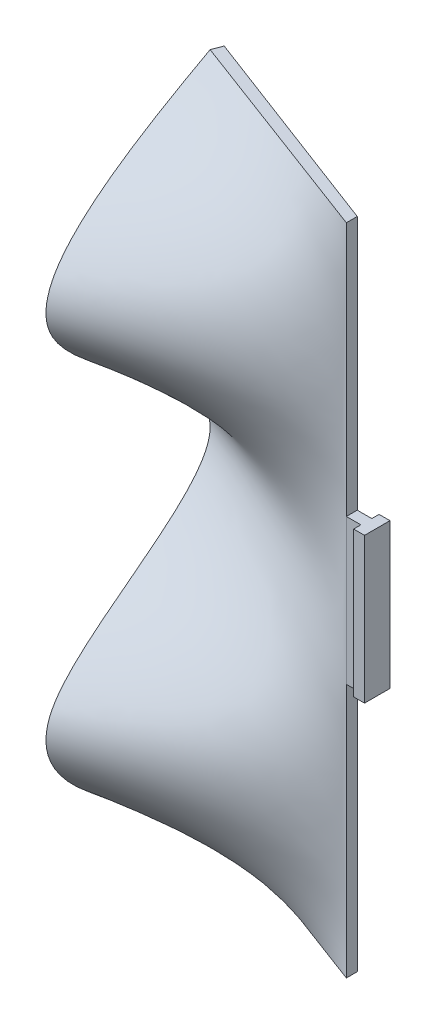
ISO-10303-21;
HEADER;
FILE_DESCRIPTION(('STEP AP214'),'2;1');
FILE_NAME('part.step','',(''),(''),'','','');
FILE_SCHEMA(('AUTOMOTIVE_DESIGN { 1 0 10303 214 1 1 1 1 }'));
ENDSEC;
DATA;
#1=APPLICATION_CONTEXT('core data for automotive mechanical design processes');
#2=APPLICATION_PROTOCOL_DEFINITION('international standard','automotive_design',2000,#1);
#3=PRODUCT_CONTEXT('',#1,'mechanical');
#4=PRODUCT('Part','Part','',(#3));
#5=PRODUCT_RELATED_PRODUCT_CATEGORY('part','',(#4));
#6=PRODUCT_DEFINITION_FORMATION('','',#4);
#7=PRODUCT_DEFINITION_CONTEXT('part definition',#1,'design');
#8=PRODUCT_DEFINITION('design','',#6,#7);
#9=PRODUCT_DEFINITION_SHAPE('','',#8);
#10=(LENGTH_UNIT() NAMED_UNIT(*) SI_UNIT(.MILLI.,.METRE.));
#11=(NAMED_UNIT(*) PLANE_ANGLE_UNIT() SI_UNIT($,.RADIAN.));
#12=(NAMED_UNIT(*) SI_UNIT($,.STERADIAN.) SOLID_ANGLE_UNIT());
#13=UNCERTAINTY_MEASURE_WITH_UNIT(LENGTH_MEASURE(1.E-05),#10,'distance_accuracy_value','');
#14=(GEOMETRIC_REPRESENTATION_CONTEXT(3) GLOBAL_UNCERTAINTY_ASSIGNED_CONTEXT((#13)) GLOBAL_UNIT_ASSIGNED_CONTEXT((#10,
#11,#12)) REPRESENTATION_CONTEXT('',''));
#15=CARTESIAN_POINT('',(0.,0.,0.));
#16=DIRECTION('',(0.,0.,1.));
#17=DIRECTION('',(1.,0.,0.));
#18=AXIS2_PLACEMENT_3D('',#15,#16,#17);
#19=CARTESIAN_POINT('',(0.,0.,3.));
#20=DIRECTION('',(1.,0.,0.));
#21=DIRECTION('',(0.,0.,-1.));
#22=AXIS2_PLACEMENT_3D('',#19,#20,#21);
#23=PLANE('',#22);
#24=DIRECTION('',(0.,1.,0.));
#25=VECTOR('',#24,1.);
#26=CARTESIAN_POINT('',(0.,90.0000000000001,0.));
#27=LINE('',#26,#25);
#28=CARTESIAN_POINT('',(0.,0.,0.));
#29=VERTEX_POINT('',#28);
#30=CARTESIAN_POINT('',(0.,70.,0.));
#31=VERTEX_POINT('',#30);
#32=EDGE_CURVE('E305',#29,#31,#27,.T.);
#33=ORIENTED_EDGE('',*,*,#32,.T.);
#34=DIRECTION('',(0.,0.,1.));
#35=VECTOR('',#34,1.);
#36=CARTESIAN_POINT('',(0.,70.,0.));
#37=LINE('',#36,#35);
#38=CARTESIAN_POINT('',(0.,70.,2.99999999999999));
#39=VERTEX_POINT('',#38);
#40=EDGE_CURVE('E60',#31,#39,#37,.T.);
#41=ORIENTED_EDGE('',*,*,#40,.T.);
#42=DIRECTION('',(0.,1.,0.));
#43=VECTOR('',#42,1.);
#44=CARTESIAN_POINT('',(0.,90.0000000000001,3.));
#45=LINE('',#44,#43);
#46=CARTESIAN_POINT('',(0.,0.,3.));
#47=VERTEX_POINT('',#46);
#48=EDGE_CURVE('E139',#47,#39,#45,.T.);
#49=ORIENTED_EDGE('',*,*,#48,.F.);
#50=DIRECTION('',(0.,0.,-1.));
#51=VECTOR('',#50,1.);
#52=CARTESIAN_POINT('',(0.,0.,3.));
#53=LINE('',#52,#51);
#54=EDGE_CURVE('E143',#47,#29,#53,.T.);
#55=ORIENTED_EDGE('',*,*,#54,.T.);
#56=EDGE_LOOP('',(#33,#41,#49,#55));
#57=FACE_BOUND('',#56,.T.);
#58=ADVANCED_FACE('F41',(#57),#23,.T.);
#59=CARTESIAN_POINT('',(0.,180.,0.));
#60=DIRECTION('',(0.,-1.,0.));
#61=DIRECTION('',(0.,0.,-1.));
#62=AXIS2_PLACEMENT_3D('',#59,#60,#61);
#63=PLANE('',#62);
#64=DIRECTION('',(0.936294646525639,0.,0.351215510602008));
#65=VECTOR('',#64,1.);
#66=CARTESIAN_POINT('',(-60.,180.,-19.5067298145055));
#67=LINE('',#66,#65);
#68=CARTESIAN_POINT('',(-60.,180.,-19.5067298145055));
#69=VERTEX_POINT('',#68);
#70=CARTESIAN_POINT('',(0.,180.,3.));
#71=VERTEX_POINT('',#70);
#72=EDGE_CURVE('E304',#69,#71,#67,.T.);
#73=ORIENTED_EDGE('',*,*,#72,.T.);
#74=DIRECTION('',(0.,0.,-1.));
#75=VECTOR('',#74,1.);
#76=CARTESIAN_POINT('',(0.,180.,3.));
#77=LINE('',#76,#75);
#78=CARTESIAN_POINT('',(0.,180.,0.));
#79=VERTEX_POINT('',#78);
#80=EDGE_CURVE('E148',#71,#79,#77,.T.);
#81=ORIENTED_EDGE('',*,*,#80,.T.);
#82=DIRECTION('',(-0.935225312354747,0.,-0.354053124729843));
#83=VECTOR('',#82,1.);
#84=CARTESIAN_POINT('',(0.,180.,0.));
#85=LINE('',#84,#83);
#86=CARTESIAN_POINT('',(-58.9378406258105,180.,-22.3124057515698));
#87=VERTEX_POINT('',#86);
#88=EDGE_CURVE('E52',#79,#87,#85,.T.);
#89=ORIENTED_EDGE('',*,*,#88,.T.);
#90=DIRECTION('',(-0.354053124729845,0.,0.935225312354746));
#91=VECTOR('',#90,1.);
#92=CARTESIAN_POINT('',(-58.9378406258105,180.,-22.3124057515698));
#93=LINE('',#92,#91);
#94=EDGE_CURVE('E12',#87,#69,#93,.T.);
#95=ORIENTED_EDGE('',*,*,#94,.T.);
#96=EDGE_LOOP('',(#73,#81,#89,#95));
#97=FACE_BOUND('',#96,.T.);
#98=ADVANCED_FACE('F43',(#97),#63,.F.);
#99=CARTESIAN_POINT('',(0.,0.,0.));
#100=DIRECTION('',(0.,-1.,0.));
#101=DIRECTION('',(0.,0.,-1.));
#102=AXIS2_PLACEMENT_3D('',#99,#100,#101);
#103=PLANE('',#102);
#104=ORIENTED_EDGE('',*,*,#54,.F.);
#105=DIRECTION('',(0.936294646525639,0.,0.351215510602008));
#106=VECTOR('',#105,1.);
#107=CARTESIAN_POINT('',(-60.,0.,-19.5067298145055));
#108=LINE('',#107,#106);
#109=CARTESIAN_POINT('',(-60.,0.,-19.5067298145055));
#110=VERTEX_POINT('',#109);
#111=EDGE_CURVE('E213',#110,#47,#108,.T.);
#112=ORIENTED_EDGE('',*,*,#111,.F.);
#113=DIRECTION('',(-0.354053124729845,0.,0.935225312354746));
#114=VECTOR('',#113,1.);
#115=CARTESIAN_POINT('',(-58.9378406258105,0.,-22.3124057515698));
#116=LINE('',#115,#114);
#117=CARTESIAN_POINT('',(-58.9378406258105,0.,-22.3124057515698));
#118=VERTEX_POINT('',#117);
#119=EDGE_CURVE('E318',#118,#110,#116,.T.);
#120=ORIENTED_EDGE('',*,*,#119,.F.);
#121=DIRECTION('',(-0.935225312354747,0.,-0.354053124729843));
#122=VECTOR('',#121,1.);
#123=CARTESIAN_POINT('',(0.,0.,0.));
#124=LINE('',#123,#122);
#125=EDGE_CURVE('E405',#29,#118,#124,.T.);
#126=ORIENTED_EDGE('',*,*,#125,.F.);
#127=EDGE_LOOP('',(#104,#112,#120,#126));
#128=FACE_BOUND('',#127,.T.);
#129=ADVANCED_FACE('F231',(#128),#103,.T.);
#130=CARTESIAN_POINT('',(-60.,0.,-19.5067298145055));
#131=CARTESIAN_POINT('',(-59.2918937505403,15.,10.3726938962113));
#132=CARTESIAN_POINT('',(-58.2297343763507,45.,55.1918294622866));
#133=CARTESIAN_POINT('',(-60.8851328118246,90.0000000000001,-56.8560094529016));
#134=CARTESIAN_POINT('',(-58.2297343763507,135.,55.1918294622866));
#135=CARTESIAN_POINT('',(-59.2918937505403,165.,10.3726938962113));
#136=CARTESIAN_POINT('',(-60.,180.,-19.5067298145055));
#137=CARTESIAN_POINT('',(-40.,0.,-12.0044865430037));
#138=CARTESIAN_POINT('',(-39.5279291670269,15.,7.9151292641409));
#139=CARTESIAN_POINT('',(-38.8198229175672,45.,37.7945529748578));
#140=CARTESIAN_POINT('',(-40.5900885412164,90.0000000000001,-36.9040063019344));
#141=CARTESIAN_POINT('',(-38.8198229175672,135.,37.7945529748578));
#142=CARTESIAN_POINT('',(-39.5279291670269,165.,7.9151292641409));
#143=CARTESIAN_POINT('',(-40.,180.,-12.0044865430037));
#144=CARTESIAN_POINT('',(-20.,0.,-4.50224327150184));
#145=CARTESIAN_POINT('',(-19.7639645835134,15.,5.45756463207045));
#146=CARTESIAN_POINT('',(-19.4099114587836,45.,20.3972764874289));
#147=CARTESIAN_POINT('',(-20.2950442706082,90.0000000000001,-16.9520031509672));
#148=CARTESIAN_POINT('',(-19.4099114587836,135.,20.3972764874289));
#149=CARTESIAN_POINT('',(-19.7639645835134,165.,5.45756463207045));
#150=CARTESIAN_POINT('',(-20.,180.,-4.50224327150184));
#151=CARTESIAN_POINT('',(0.,0.,3.));
#152=CARTESIAN_POINT('',(0.,15.,3.));
#153=CARTESIAN_POINT('',(0.,45.,3.));
#154=CARTESIAN_POINT('',(0.,90.0000000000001,2.99999999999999));
#155=CARTESIAN_POINT('',(0.,135.,3.));
#156=CARTESIAN_POINT('',(0.,165.,3.));
#157=CARTESIAN_POINT('',(0.,180.,3.));
#158=B_SPLINE_SURFACE_WITH_KNOTS('',3,3,((#130,#131,#132,#133,#134,#135,#136),(#137,#138,#139,
#140,#141,#142,#143),(#144,#145,#146,#147,#148,#149,#150),(#151,#152,#153,#154,#155,#156,#157)),
.UNSPECIFIED.,.F.,.F.,.F.,(4,4),(4,1,1,1,4),(0.,1.),(0.,0.25,0.5,0.75,1.),.UNSPECIFIED.);
#159=DIRECTION('',(0.,-1.,0.));
#160=VECTOR('',#159,1.);
#161=CARTESIAN_POINT('',(0.,110.,3.));
#162=LINE('',#161,#160);
#163=CARTESIAN_POINT('',(0.,110.,3.));
#164=VERTEX_POINT('',#163);
#165=EDGE_CURVE('E134',#164,#39,#162,.T.);
#166=EDGE_CURVE('E46',#164,#71,#45,.T.);
#167=CARTESIAN_POINT('',(-60.,0.,-19.5067298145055));
#168=CARTESIAN_POINT('',(-59.2918937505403,15.,10.3726938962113));
#169=CARTESIAN_POINT('',(-58.2297343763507,45.,55.1918294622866));
#170=CARTESIAN_POINT('',(-60.8851328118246,90.0000000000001,-56.8560094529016));
#171=CARTESIAN_POINT('',(-58.2297343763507,135.,55.1918294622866));
#172=CARTESIAN_POINT('',(-59.2918937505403,165.,10.3726938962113));
#173=CARTESIAN_POINT('',(-60.,180.,-19.5067298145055));
#174=B_SPLINE_CURVE_WITH_KNOTS('',3,(#167,#168,#169,#170,#171,#172,#173),.UNSPECIFIED.,.F.,.F.,
(4,1,1,1,4),(0.,0.25,0.5,0.75,1.),.UNSPECIFIED.);
#175=EDGE_CURVE('E151',#69,#110,#174,.F.);
#176=ORIENTED_EDGE('',*,*,#111,.T.);
#177=ORIENTED_EDGE('',*,*,#48,.T.);
#178=ORIENTED_EDGE('',*,*,#165,.F.);
#179=ORIENTED_EDGE('',*,*,#166,.T.);
#180=ORIENTED_EDGE('',*,*,#72,.F.);
#181=ORIENTED_EDGE('',*,*,#175,.T.);
#182=EDGE_LOOP('',(#176,#177,#178,#179,#180,#181));
#183=FACE_BOUND('',#182,.T.);
#184=ADVANCED_FACE('F136',(#183),#158,.T.);
#185=DIRECTION('',(0.,0.,1.));
#186=VECTOR('',#185,1.);
#187=CARTESIAN_POINT('',(0.,110.,0.));
#188=LINE('',#187,#186);
#189=CARTESIAN_POINT('',(0.,110.,0.));
#190=VERTEX_POINT('',#189);
#191=EDGE_CURVE('E68',#190,#164,#188,.T.);
#192=ORIENTED_EDGE('',*,*,#191,.F.);
#193=EDGE_CURVE('E374',#190,#79,#27,.T.);
#194=ORIENTED_EDGE('',*,*,#193,.T.);
#195=ORIENTED_EDGE('',*,*,#80,.F.);
#196=ORIENTED_EDGE('',*,*,#166,.F.);
#197=EDGE_LOOP('',(#192,#194,#195,#196));
#198=FACE_BOUND('',#197,.T.);
#199=ADVANCED_FACE('F146',(#198),#23,.T.);
#200=CARTESIAN_POINT('',(-58.9378406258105,0.,-22.3124057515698));
#201=CARTESIAN_POINT('',(-59.6459468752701,15.,7.56701795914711));
#202=CARTESIAN_POINT('',(-60.7081062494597,45.,52.3861535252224));
#203=CARTESIAN_POINT('',(-58.0527078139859,90.0000000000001,-59.6616853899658));
#204=CARTESIAN_POINT('',(-60.7081062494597,135.,52.3861535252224));
#205=CARTESIAN_POINT('',(-59.6459468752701,165.,7.56701795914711));
#206=CARTESIAN_POINT('',(-58.9378406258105,180.,-22.3124057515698));
#207=CARTESIAN_POINT('',(-59.2918937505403,0.,-21.377180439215));
#208=CARTESIAN_POINT('',(-59.5279291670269,15.,8.50224327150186));
#209=CARTESIAN_POINT('',(-59.8819822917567,45.,53.3213788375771));
#210=CARTESIAN_POINT('',(-58.9968494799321,90.0000000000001,-58.7264600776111));
#211=CARTESIAN_POINT('',(-59.8819822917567,135.,53.3213788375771));
#212=CARTESIAN_POINT('',(-59.5279291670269,165.,8.50224327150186));
#213=CARTESIAN_POINT('',(-59.2918937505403,180.,-21.377180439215));
#214=CARTESIAN_POINT('',(-59.6459468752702,0.,-20.4419551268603));
#215=CARTESIAN_POINT('',(-59.4099114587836,15.,9.4374685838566));
#216=CARTESIAN_POINT('',(-59.0558583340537,45.,54.2566041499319));
#217=CARTESIAN_POINT('',(-59.9409911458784,90.0000000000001,-57.7912347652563));
#218=CARTESIAN_POINT('',(-59.0558583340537,135.,54.2566041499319));
#219=CARTESIAN_POINT('',(-59.4099114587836,165.,9.4374685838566));
#220=CARTESIAN_POINT('',(-59.6459468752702,180.,-20.4419551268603));
#221=CARTESIAN_POINT('',(-60.,0.,-19.5067298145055));
#222=CARTESIAN_POINT('',(-59.2918937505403,15.,10.3726938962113));
#223=CARTESIAN_POINT('',(-58.2297343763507,45.,55.1918294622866));
#224=CARTESIAN_POINT('',(-60.8851328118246,90.0000000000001,-56.8560094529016));
#225=CARTESIAN_POINT('',(-58.2297343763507,135.,55.1918294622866));
#226=CARTESIAN_POINT('',(-59.2918937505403,165.,10.3726938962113));
#227=CARTESIAN_POINT('',(-60.,180.,-19.5067298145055));
#228=B_SPLINE_SURFACE_WITH_KNOTS('',3,3,((#200,#201,#202,#203,#204,#205,#206),(#207,#208,#209,
#210,#211,#212,#213),(#214,#215,#216,#217,#218,#219,#220),(#221,#222,#223,#224,#225,#226,#227)),
.UNSPECIFIED.,.F.,.F.,.F.,(4,4),(4,1,1,1,4),(0.,1.),(0.,0.25,0.5,0.75,1.),.UNSPECIFIED.);
#229=CARTESIAN_POINT('',(-58.9378406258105,0.,-22.3124057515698));
#230=CARTESIAN_POINT('',(-59.6459468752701,15.,7.56701795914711));
#231=CARTESIAN_POINT('',(-60.7081062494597,45.,52.3861535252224));
#232=CARTESIAN_POINT('',(-58.0527078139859,90.0000000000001,-59.6616853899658));
#233=CARTESIAN_POINT('',(-60.7081062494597,135.,52.3861535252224));
#234=CARTESIAN_POINT('',(-59.6459468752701,165.,7.56701795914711));
#235=CARTESIAN_POINT('',(-58.9378406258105,180.,-22.3124057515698));
#236=B_SPLINE_CURVE_WITH_KNOTS('',3,(#229,#230,#231,#232,#233,#234,#235),.UNSPECIFIED.,.F.,.F.,
(4,1,1,1,4),(0.,0.25,0.5,0.75,1.),.UNSPECIFIED.);
#237=EDGE_CURVE('E297',#118,#87,#236,.T.);
#238=ORIENTED_EDGE('',*,*,#119,.T.);
#239=ORIENTED_EDGE('',*,*,#175,.F.);
#240=ORIENTED_EDGE('',*,*,#94,.F.);
#241=ORIENTED_EDGE('',*,*,#237,.F.);
#242=EDGE_LOOP('',(#238,#239,#240,#241));
#243=FACE_BOUND('',#242,.T.);
#244=ADVANCED_FACE('F280',(#243),#228,.T.);
#245=CARTESIAN_POINT('',(0.,0.,0.));
#246=CARTESIAN_POINT('',(0.,15.,0.));
#247=CARTESIAN_POINT('',(0.,45.,0.));
#248=CARTESIAN_POINT('',(0.,90.0000000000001,0.));
#249=CARTESIAN_POINT('',(0.,135.,0.));
#250=CARTESIAN_POINT('',(0.,165.,0.));
#251=CARTESIAN_POINT('',(0.,180.,0.));
#252=CARTESIAN_POINT('',(-19.6459468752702,0.,-7.43746858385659));
#253=CARTESIAN_POINT('',(-19.8819822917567,15.,2.52233931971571));
#254=CARTESIAN_POINT('',(-20.2360354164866,45.,17.4620511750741));
#255=CARTESIAN_POINT('',(-19.350902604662,90.0000000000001,-19.8872284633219));
#256=CARTESIAN_POINT('',(-20.2360354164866,135.,17.4620511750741));
#257=CARTESIAN_POINT('',(-19.8819822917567,165.,2.52233931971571));
#258=CARTESIAN_POINT('',(-19.6459468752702,180.,-7.43746858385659));
#259=CARTESIAN_POINT('',(-39.2918937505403,0.,-14.8749371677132));
#260=CARTESIAN_POINT('',(-39.7639645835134,15.,5.0446786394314));
#261=CARTESIAN_POINT('',(-40.4720708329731,45.,34.9241023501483));
#262=CARTESIAN_POINT('',(-38.7018052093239,90.0000000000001,-39.7744569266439));
#263=CARTESIAN_POINT('',(-40.4720708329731,135.,34.9241023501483));
#264=CARTESIAN_POINT('',(-39.7639645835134,165.,5.0446786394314));
#265=CARTESIAN_POINT('',(-39.2918937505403,180.,-14.8749371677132));
#266=CARTESIAN_POINT('',(-58.9378406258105,0.,-22.3124057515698));
#267=CARTESIAN_POINT('',(-59.6459468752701,15.,7.56701795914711));
#268=CARTESIAN_POINT('',(-60.7081062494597,45.,52.3861535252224));
#269=CARTESIAN_POINT('',(-58.0527078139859,90.0000000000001,-59.6616853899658));
#270=CARTESIAN_POINT('',(-60.7081062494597,135.,52.3861535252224));
#271=CARTESIAN_POINT('',(-59.6459468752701,165.,7.56701795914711));
#272=CARTESIAN_POINT('',(-58.9378406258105,180.,-22.3124057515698));
#273=B_SPLINE_SURFACE_WITH_KNOTS('',3,3,((#245,#246,#247,#248,#249,#250,#251),(#252,#253,#254,
#255,#256,#257,#258),(#259,#260,#261,#262,#263,#264,#265),(#266,#267,#268,#269,#270,#271,#272)),
.UNSPECIFIED.,.F.,.F.,.F.,(4,4),(4,1,1,1,4),(0.,1.),(0.,0.25,0.5,0.75,1.),.UNSPECIFIED.);
#274=DIRECTION('',(0.,-1.,0.));
#275=VECTOR('',#274,1.);
#276=CARTESIAN_POINT('',(0.,110.,0.));
#277=LINE('',#276,#275);
#278=EDGE_CURVE('E181',#190,#31,#277,.T.);
#279=ORIENTED_EDGE('',*,*,#125,.T.);
#280=ORIENTED_EDGE('',*,*,#237,.T.);
#281=ORIENTED_EDGE('',*,*,#88,.F.);
#282=ORIENTED_EDGE('',*,*,#193,.F.);
#283=ORIENTED_EDGE('',*,*,#278,.T.);
#284=ORIENTED_EDGE('',*,*,#32,.F.);
#285=EDGE_LOOP('',(#279,#280,#281,#282,#283,#284));
#286=FACE_BOUND('',#285,.T.);
#287=ADVANCED_FACE('F270',(#286),#273,.T.);
#288=CARTESIAN_POINT('',(0.,110.,3.));
#289=DIRECTION('',(0.,0.,-1.));
#290=DIRECTION('',(-1.,0.,0.));
#291=AXIS2_PLACEMENT_3D('',#288,#289,#290);
#292=PLANE('',#291);
#293=DIRECTION('',(1.,0.,0.));
#294=VECTOR('',#293,1.);
#295=CARTESIAN_POINT('',(0.,70.,3.));
#296=LINE('',#295,#294);
#297=CARTESIAN_POINT('',(4.,70.,3.));
#298=VERTEX_POINT('',#297);
#299=EDGE_CURVE('E183',#39,#298,#296,.T.);
#300=ORIENTED_EDGE('',*,*,#299,.T.);
#301=DIRECTION('',(0.,-1.,0.));
#302=VECTOR('',#301,1.);
#303=CARTESIAN_POINT('',(4.,110.,3.));
#304=LINE('',#303,#302);
#305=CARTESIAN_POINT('',(4.,110.,3.));
#306=VERTEX_POINT('',#305);
#307=EDGE_CURVE('E144',#306,#298,#304,.T.);
#308=ORIENTED_EDGE('',*,*,#307,.F.);
#309=DIRECTION('',(1.,0.,0.));
#310=VECTOR('',#309,1.);
#311=CARTESIAN_POINT('',(0.,110.,3.));
#312=LINE('',#311,#310);
#313=EDGE_CURVE('E153',#164,#306,#312,.T.);
#314=ORIENTED_EDGE('',*,*,#313,.F.);
#315=ORIENTED_EDGE('',*,*,#165,.T.);
#316=EDGE_LOOP('',(#300,#308,#314,#315));
#317=FACE_BOUND('',#316,.T.);
#318=ADVANCED_FACE('F154',(#317),#292,.F.);
#319=CARTESIAN_POINT('',(4.,110.,3.));
#320=DIRECTION('',(1.,0.,0.));
#321=DIRECTION('',(0.,0.,-1.));
#322=AXIS2_PLACEMENT_3D('',#319,#320,#321);
#323=PLANE('',#322);
#324=DIRECTION('',(0.,0.,1.));
#325=VECTOR('',#324,1.);
#326=CARTESIAN_POINT('',(4.,70.,3.));
#327=LINE('',#326,#325);
#328=CARTESIAN_POINT('',(4.,70.,5.));
#329=VERTEX_POINT('',#328);
#330=EDGE_CURVE('E185',#298,#329,#327,.T.);
#331=ORIENTED_EDGE('',*,*,#330,.T.);
#332=DIRECTION('',(0.,-1.,0.));
#333=VECTOR('',#332,1.);
#334=CARTESIAN_POINT('',(4.,110.,5.));
#335=LINE('',#334,#333);
#336=CARTESIAN_POINT('',(4.,110.,5.));
#337=VERTEX_POINT('',#336);
#338=EDGE_CURVE('E207',#337,#329,#335,.T.);
#339=ORIENTED_EDGE('',*,*,#338,.F.);
#340=DIRECTION('',(0.,0.,1.));
#341=VECTOR('',#340,1.);
#342=CARTESIAN_POINT('',(4.,110.,3.));
#343=LINE('',#342,#341);
#344=EDGE_CURVE('E158',#306,#337,#343,.T.);
#345=ORIENTED_EDGE('',*,*,#344,.F.);
#346=ORIENTED_EDGE('',*,*,#307,.T.);
#347=EDGE_LOOP('',(#331,#339,#345,#346));
#348=FACE_BOUND('',#347,.T.);
#349=ADVANCED_FACE('F416',(#348),#323,.F.);
#350=CARTESIAN_POINT('',(4.,110.,5.));
#351=DIRECTION('',(0.,0.,-1.));
#352=DIRECTION('',(-1.,0.,0.));
#353=AXIS2_PLACEMENT_3D('',#350,#351,#352);
#354=PLANE('',#353);
#355=DIRECTION('',(1.,0.,0.));
#356=VECTOR('',#355,1.);
#357=CARTESIAN_POINT('',(4.,70.,5.));
#358=LINE('',#357,#356);
#359=CARTESIAN_POINT('',(7.,70.,5.));
#360=VERTEX_POINT('',#359);
#361=EDGE_CURVE('E187',#329,#360,#358,.T.);
#362=ORIENTED_EDGE('',*,*,#361,.T.);
#363=DIRECTION('',(0.,-1.,0.));
#364=VECTOR('',#363,1.);
#365=CARTESIAN_POINT('',(7.,110.,5.));
#366=LINE('',#365,#364);
#367=CARTESIAN_POINT('',(7.,110.,5.));
#368=VERTEX_POINT('',#367);
#369=EDGE_CURVE('E204',#368,#360,#366,.T.);
#370=ORIENTED_EDGE('',*,*,#369,.F.);
#371=DIRECTION('',(1.,0.,0.));
#372=VECTOR('',#371,1.);
#373=CARTESIAN_POINT('',(4.,110.,5.));
#374=LINE('',#373,#372);
#375=EDGE_CURVE('E172',#337,#368,#374,.T.);
#376=ORIENTED_EDGE('',*,*,#375,.F.);
#377=ORIENTED_EDGE('',*,*,#338,.T.);
#378=EDGE_LOOP('',(#362,#370,#376,#377));
#379=FACE_BOUND('',#378,.T.);
#380=ADVANCED_FACE('F423',(#379),#354,.F.);
#381=CARTESIAN_POINT('',(7.,110.,-2.));
#382=DIRECTION('',(-1.,0.,0.));
#383=DIRECTION('',(0.,0.,1.));
#384=AXIS2_PLACEMENT_3D('',#381,#382,#383);
#385=PLANE('',#384);
#386=DIRECTION('',(0.,0.,-1.));
#387=VECTOR('',#386,1.);
#388=CARTESIAN_POINT('',(7.,70.,-2.));
#389=LINE('',#388,#387);
#390=CARTESIAN_POINT('',(7.,70.,-2.));
#391=VERTEX_POINT('',#390);
#392=EDGE_CURVE('E189',#360,#391,#389,.T.);
#393=ORIENTED_EDGE('',*,*,#392,.T.);
#394=DIRECTION('',(0.,-1.,0.));
#395=VECTOR('',#394,1.);
#396=CARTESIAN_POINT('',(7.,110.,-2.));
#397=LINE('',#396,#395);
#398=CARTESIAN_POINT('',(7.,110.,-2.));
#399=VERTEX_POINT('',#398);
#400=EDGE_CURVE('E201',#399,#391,#397,.T.);
#401=ORIENTED_EDGE('',*,*,#400,.F.);
#402=DIRECTION('',(0.,0.,-1.));
#403=VECTOR('',#402,1.);
#404=CARTESIAN_POINT('',(7.,110.,-2.));
#405=LINE('',#404,#403);
#406=EDGE_CURVE('E174',#368,#399,#405,.T.);
#407=ORIENTED_EDGE('',*,*,#406,.F.);
#408=ORIENTED_EDGE('',*,*,#369,.T.);
#409=EDGE_LOOP('',(#393,#401,#407,#408));
#410=FACE_BOUND('',#409,.T.);
#411=ADVANCED_FACE('F426',(#410),#385,.F.);
#412=CARTESIAN_POINT('',(4.,110.,-2.));
#413=DIRECTION('',(0.,0.,1.));
#414=DIRECTION('',(1.,0.,0.));
#415=AXIS2_PLACEMENT_3D('',#412,#413,#414);
#416=PLANE('',#415);
#417=DIRECTION('',(-1.,0.,0.));
#418=VECTOR('',#417,1.);
#419=CARTESIAN_POINT('',(4.,70.,-2.));
#420=LINE('',#419,#418);
#421=CARTESIAN_POINT('',(4.,70.,-2.));
#422=VERTEX_POINT('',#421);
#423=EDGE_CURVE('E191',#391,#422,#420,.T.);
#424=ORIENTED_EDGE('',*,*,#423,.T.);
#425=DIRECTION('',(0.,-1.,0.));
#426=VECTOR('',#425,1.);
#427=CARTESIAN_POINT('',(4.,110.,-2.));
#428=LINE('',#427,#426);
#429=CARTESIAN_POINT('',(4.,110.,-2.));
#430=VERTEX_POINT('',#429);
#431=EDGE_CURVE('E198',#430,#422,#428,.T.);
#432=ORIENTED_EDGE('',*,*,#431,.F.);
#433=DIRECTION('',(-1.,0.,0.));
#434=VECTOR('',#433,1.);
#435=CARTESIAN_POINT('',(4.,110.,-2.));
#436=LINE('',#435,#434);
#437=EDGE_CURVE('E176',#399,#430,#436,.T.);
#438=ORIENTED_EDGE('',*,*,#437,.F.);
#439=ORIENTED_EDGE('',*,*,#400,.T.);
#440=EDGE_LOOP('',(#424,#432,#438,#439));
#441=FACE_BOUND('',#440,.T.);
#442=ADVANCED_FACE('F431',(#441),#416,.F.);
#443=CARTESIAN_POINT('',(4.,110.,-2.));
#444=DIRECTION('',(1.,0.,0.));
#445=DIRECTION('',(0.,0.,-1.));
#446=AXIS2_PLACEMENT_3D('',#443,#444,#445);
#447=PLANE('',#446);
#448=DIRECTION('',(0.,0.,1.));
#449=VECTOR('',#448,1.);
#450=CARTESIAN_POINT('',(4.,70.,-2.));
#451=LINE('',#450,#449);
#452=CARTESIAN_POINT('',(4.,70.,0.));
#453=VERTEX_POINT('',#452);
#454=EDGE_CURVE('E168',#422,#453,#451,.T.);
#455=ORIENTED_EDGE('',*,*,#454,.T.);
#456=DIRECTION('',(0.,-1.,0.));
#457=VECTOR('',#456,1.);
#458=CARTESIAN_POINT('',(4.,110.,0.));
#459=LINE('',#458,#457);
#460=CARTESIAN_POINT('',(4.,110.,0.));
#461=VERTEX_POINT('',#460);
#462=EDGE_CURVE('E195',#461,#453,#459,.T.);
#463=ORIENTED_EDGE('',*,*,#462,.F.);
#464=DIRECTION('',(0.,0.,1.));
#465=VECTOR('',#464,1.);
#466=CARTESIAN_POINT('',(4.,110.,-2.));
#467=LINE('',#466,#465);
#468=EDGE_CURVE('E178',#430,#461,#467,.T.);
#469=ORIENTED_EDGE('',*,*,#468,.F.);
#470=ORIENTED_EDGE('',*,*,#431,.T.);
#471=EDGE_LOOP('',(#455,#463,#469,#470));
#472=FACE_BOUND('',#471,.T.);
#473=ADVANCED_FACE('F434',(#472),#447,.F.);
#474=CARTESIAN_POINT('',(0.,110.,0.));
#475=DIRECTION('',(0.,0.,1.));
#476=DIRECTION('',(1.,0.,0.));
#477=AXIS2_PLACEMENT_3D('',#474,#475,#476);
#478=PLANE('',#477);
#479=DIRECTION('',(-1.,0.,0.));
#480=VECTOR('',#479,1.);
#481=CARTESIAN_POINT('',(0.,70.,0.));
#482=LINE('',#481,#480);
#483=EDGE_CURVE('E165',#453,#31,#482,.T.);
#484=ORIENTED_EDGE('',*,*,#483,.T.);
#485=ORIENTED_EDGE('',*,*,#278,.F.);
#486=DIRECTION('',(-1.,0.,0.));
#487=VECTOR('',#486,1.);
#488=CARTESIAN_POINT('',(0.,110.,0.));
#489=LINE('',#488,#487);
#490=EDGE_CURVE('E163',#461,#190,#489,.T.);
#491=ORIENTED_EDGE('',*,*,#490,.F.);
#492=ORIENTED_EDGE('',*,*,#462,.T.);
#493=EDGE_LOOP('',(#484,#485,#491,#492));
#494=FACE_BOUND('',#493,.T.);
#495=ADVANCED_FACE('F407',(#494),#478,.F.);
#496=CARTESIAN_POINT('',(0.,110.,0.));
#497=DIRECTION('',(0.,1.,0.));
#498=DIRECTION('',(0.,0.,1.));
#499=AXIS2_PLACEMENT_3D('',#496,#497,#498);
#500=PLANE('',#499);
#501=ORIENTED_EDGE('',*,*,#191,.T.);
#502=ORIENTED_EDGE('',*,*,#313,.T.);
#503=ORIENTED_EDGE('',*,*,#344,.T.);
#504=ORIENTED_EDGE('',*,*,#375,.T.);
#505=ORIENTED_EDGE('',*,*,#406,.T.);
#506=ORIENTED_EDGE('',*,*,#437,.T.);
#507=ORIENTED_EDGE('',*,*,#468,.T.);
#508=ORIENTED_EDGE('',*,*,#490,.T.);
#509=EDGE_LOOP('',(#501,#502,#503,#504,#505,#506,#507,#508));
#510=FACE_BOUND('',#509,.T.);
#511=ADVANCED_FACE('F161',(#510),#500,.T.);
#512=CARTESIAN_POINT('',(0.,70.,0.));
#513=DIRECTION('',(0.,1.,0.));
#514=DIRECTION('',(0.,0.,1.));
#515=AXIS2_PLACEMENT_3D('',#512,#513,#514);
#516=PLANE('',#515);
#517=ORIENTED_EDGE('',*,*,#40,.F.);
#518=ORIENTED_EDGE('',*,*,#483,.F.);
#519=ORIENTED_EDGE('',*,*,#454,.F.);
#520=ORIENTED_EDGE('',*,*,#423,.F.);
#521=ORIENTED_EDGE('',*,*,#392,.F.);
#522=ORIENTED_EDGE('',*,*,#361,.F.);
#523=ORIENTED_EDGE('',*,*,#330,.F.);
#524=ORIENTED_EDGE('',*,*,#299,.F.);
#525=EDGE_LOOP('',(#517,#518,#519,#520,#521,#522,#523,#524));
#526=FACE_BOUND('',#525,.T.);
#527=ADVANCED_FACE('F412',(#526),#516,.F.);
#528=CLOSED_SHELL('',(#58,#98,#129,#184,#199,#244,#287,#318,#349,#380,#411,#442,#473,#495,#511,#527));
#529=MANIFOLD_SOLID_BREP('B2',#528);
#530=ADVANCED_BREP_SHAPE_REPRESENTATION('',(#18,#529),#14);
#531=SHAPE_DEFINITION_REPRESENTATION(#9,#530);
ENDSEC;
END-ISO-10303-21;
